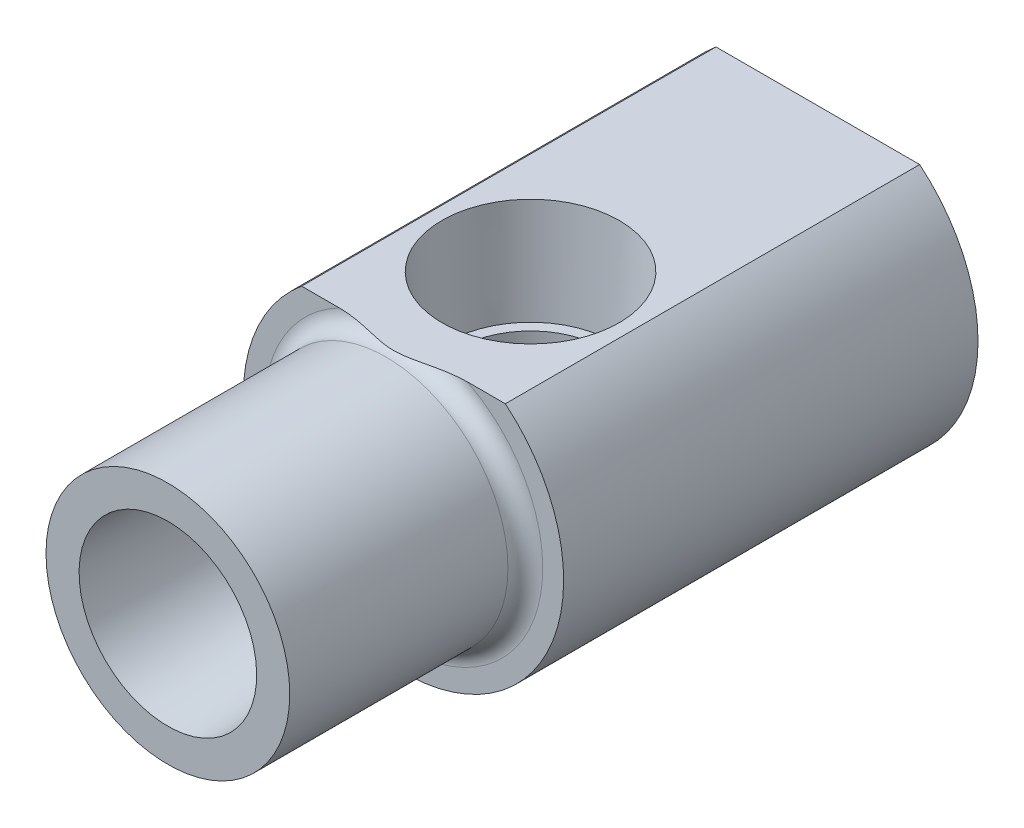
ISO-10303-21;
HEADER;
FILE_DESCRIPTION(('STEP AP214'),'2;1');
FILE_NAME('part.step','',(''),(''),'','','');
FILE_SCHEMA(('AUTOMOTIVE_DESIGN { 1 0 10303 214 1 1 1 1 }'));
ENDSEC;
DATA;
#1=APPLICATION_CONTEXT('core data for automotive mechanical design processes');
#2=APPLICATION_PROTOCOL_DEFINITION('international standard','automotive_design',2000,#1);
#3=PRODUCT_CONTEXT('',#1,'mechanical');
#4=PRODUCT('Part','Part','',(#3));
#5=PRODUCT_RELATED_PRODUCT_CATEGORY('part','',(#4));
#6=PRODUCT_DEFINITION_FORMATION('','',#4);
#7=PRODUCT_DEFINITION_CONTEXT('part definition',#1,'design');
#8=PRODUCT_DEFINITION('design','',#6,#7);
#9=PRODUCT_DEFINITION_SHAPE('','',#8);
#10=(LENGTH_UNIT() NAMED_UNIT(*) SI_UNIT(.MILLI.,.METRE.));
#11=(NAMED_UNIT(*) PLANE_ANGLE_UNIT() SI_UNIT($,.RADIAN.));
#12=(NAMED_UNIT(*) SI_UNIT($,.STERADIAN.) SOLID_ANGLE_UNIT());
#13=UNCERTAINTY_MEASURE_WITH_UNIT(LENGTH_MEASURE(1.E-05),#10,'distance_accuracy_value','');
#14=(GEOMETRIC_REPRESENTATION_CONTEXT(3) GLOBAL_UNCERTAINTY_ASSIGNED_CONTEXT((#13)) GLOBAL_UNIT_ASSIGNED_CONTEXT((#10,
#11,#12)) REPRESENTATION_CONTEXT('',''));
#15=CARTESIAN_POINT('',(0.,0.,0.));
#16=DIRECTION('',(0.,0.,1.));
#17=DIRECTION('',(1.,0.,0.));
#18=AXIS2_PLACEMENT_3D('',#15,#16,#17);
#19=CARTESIAN_POINT('',(-3.175,0.,-7.112));
#20=DIRECTION('',(0.,0.,1.));
#21=DIRECTION('',(1.,0.,0.));
#22=AXIS2_PLACEMENT_3D('',#19,#20,#21);
#23=PLANE('',#22);
#24=CARTESIAN_POINT('',(0.,-0.206790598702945,-7.112));
#25=DIRECTION('',(0.,0.,1.));
#26=DIRECTION('',(0.,1.,0.));
#27=AXIS2_PLACEMENT_3D('',#24,#25,#26);
#28=ELLIPSE('',#27,2.91070678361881,2.77750646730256);
#29=CARTESIAN_POINT('',(0.,2.70391618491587,-7.112));
#30=VERTEX_POINT('',#29);
#31=EDGE_CURVE('E118',#30,#30,#28,.F.);
#32=ORIENTED_EDGE('',*,*,#31,.T.);
#33=EDGE_LOOP('',(#32));
#34=FACE_BOUND('',#33,.T.);
#35=CARTESIAN_POINT('',(0.,0.,-7.11200000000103));
#36=DIRECTION('',(0.,0.,-1.));
#37=DIRECTION('',(0.,1.,0.));
#38=AXIS2_PLACEMENT_3D('',#35,#36,#37);
#39=CIRCLE('',#38,3.51347587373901);
#40=CARTESIAN_POINT('',(0.,3.51347587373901,-7.11200000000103));
#41=VERTEX_POINT('',#40);
#42=EDGE_CURVE('E418',#41,#41,#39,.T.);
#43=ORIENTED_EDGE('',*,*,#42,.F.);
#44=EDGE_LOOP('',(#43));
#45=FACE_BOUND('',#44,.T.);
#46=ADVANCED_FACE('F16',(#34,#45),#23,.T.);
#47=CARTESIAN_POINT('',(-3.175,0.,0.));
#48=DIRECTION('',(0.,0.,1.));
#49=DIRECTION('',(1.,0.,0.));
#50=AXIS2_PLACEMENT_3D('',#47,#48,#49);
#51=PLANE('',#50);
#52=CARTESIAN_POINT('',(0.,0.,0.));
#53=DIRECTION('',(0.,0.,-1.));
#54=DIRECTION('',(0.,1.,0.));
#55=AXIS2_PLACEMENT_3D('',#52,#53,#54);
#56=CIRCLE('',#55,3.8862);
#57=CARTESIAN_POINT('',(0.,3.8862,0.));
#58=VERTEX_POINT('',#57);
#59=EDGE_CURVE('E415',#58,#58,#56,.T.);
#60=ORIENTED_EDGE('',*,*,#59,.T.);
#61=EDGE_LOOP('',(#60));
#62=FACE_BOUND('',#61,.T.);
#63=CARTESIAN_POINT('',(0.,0.,0.));
#64=DIRECTION('',(0.,0.,1.));
#65=DIRECTION('',(1.,0.,0.));
#66=AXIS2_PLACEMENT_3D('',#63,#64,#65);
#67=CIRCLE('',#66,5.334);
#68=CARTESIAN_POINT('',(5.334,0.,0.));
#69=VERTEX_POINT('',#68);
#70=EDGE_CURVE('E420',#69,#69,#67,.F.);
#71=ORIENTED_EDGE('',*,*,#70,.F.);
#72=EDGE_LOOP('',(#71));
#73=FACE_BOUND('',#72,.T.);
#74=ADVANCED_FACE('F143',(#62,#73),#51,.T.);
#75=CARTESIAN_POINT('',(-7.0104,0.,-28.448));
#76=DIRECTION('',(0.,0.,-1.));
#77=DIRECTION('',(-1.,0.,0.));
#78=AXIS2_PLACEMENT_3D('',#75,#76,#77);
#79=PLANE('',#78);
#80=DIRECTION('',(1.,0.,0.));
#81=VECTOR('',#80,1.);
#82=CARTESIAN_POINT('',(-1.83308710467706,3.175,-28.448));
#83=LINE('',#82,#81);
#84=CARTESIAN_POINT('',(-1.83308710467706,3.175,-28.448));
#85=VERTEX_POINT('',#84);
#86=CARTESIAN_POINT('',(1.83308710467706,3.175,-28.448));
#87=VERTEX_POINT('',#86);
#88=EDGE_CURVE('E204',#85,#87,#83,.T.);
#89=ORIENTED_EDGE('',*,*,#88,.F.);
#90=DIRECTION('',(0.5,0.866025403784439,0.));
#91=VECTOR('',#90,1.);
#92=CARTESIAN_POINT('',(-3.66617420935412,0.,-28.448));
#93=LINE('',#92,#91);
#94=CARTESIAN_POINT('',(-3.66617420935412,0.,-28.448));
#95=VERTEX_POINT('',#94);
#96=EDGE_CURVE('E182',#95,#85,#93,.T.);
#97=ORIENTED_EDGE('',*,*,#96,.F.);
#98=DIRECTION('',(-0.5,0.866025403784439,0.));
#99=VECTOR('',#98,1.);
#100=CARTESIAN_POINT('',(-1.83308710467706,-3.175,-28.448));
#101=LINE('',#100,#99);
#102=CARTESIAN_POINT('',(-1.83308710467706,-3.175,-28.448));
#103=VERTEX_POINT('',#102);
#104=EDGE_CURVE('E187',#103,#95,#101,.T.);
#105=ORIENTED_EDGE('',*,*,#104,.F.);
#106=DIRECTION('',(-1.,0.,0.));
#107=VECTOR('',#106,1.);
#108=CARTESIAN_POINT('',(1.83308710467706,-3.175,-28.448));
#109=LINE('',#108,#107);
#110=CARTESIAN_POINT('',(1.83308710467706,-3.175,-28.448));
#111=VERTEX_POINT('',#110);
#112=EDGE_CURVE('E212',#111,#103,#109,.T.);
#113=ORIENTED_EDGE('',*,*,#112,.F.);
#114=DIRECTION('',(-0.5,-0.866025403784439,0.));
#115=VECTOR('',#114,1.);
#116=CARTESIAN_POINT('',(3.66617420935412,0.,-28.448));
#117=LINE('',#116,#115);
#118=CARTESIAN_POINT('',(3.66617420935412,0.,-28.448));
#119=VERTEX_POINT('',#118);
#120=EDGE_CURVE('E209',#119,#111,#117,.T.);
#121=ORIENTED_EDGE('',*,*,#120,.F.);
#122=DIRECTION('',(0.5,-0.866025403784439,0.));
#123=VECTOR('',#122,1.);
#124=CARTESIAN_POINT('',(1.83308710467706,3.175,-28.448));
#125=LINE('',#124,#123);
#126=EDGE_CURVE('E206',#87,#119,#125,.T.);
#127=ORIENTED_EDGE('',*,*,#126,.F.);
#128=EDGE_LOOP('',(#89,#97,#105,#113,#121,#127));
#129=FACE_BOUND('',#128,.T.);
#130=DIRECTION('',(-1.,0.,0.));
#131=VECTOR('',#130,1.);
#132=CARTESIAN_POINT('',(-4.4577,5.41060244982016,-28.448));
#133=LINE('',#132,#131);
#134=CARTESIAN_POINT('',(4.4577,5.41060244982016,-28.448));
#135=VERTEX_POINT('',#134);
#136=CARTESIAN_POINT('',(-4.4577,5.41060244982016,-28.448));
#137=VERTEX_POINT('',#136);
#138=EDGE_CURVE('E81',#135,#137,#133,.T.);
#139=ORIENTED_EDGE('',*,*,#138,.F.);
#140=CARTESIAN_POINT('',(0.,0.,-28.448));
#141=DIRECTION('',(0.,0.,-1.));
#142=DIRECTION('',(-1.,0.,0.));
#143=AXIS2_PLACEMENT_3D('',#140,#141,#142);
#144=CIRCLE('',#143,7.0104);
#145=EDGE_CURVE('E20',#135,#137,#144,.T.);
#146=ORIENTED_EDGE('',*,*,#145,.T.);
#147=EDGE_LOOP('',(#139,#146));
#148=FACE_BOUND('',#147,.T.);
#149=ADVANCED_FACE('F18',(#129,#148),#79,.T.);
#150=CARTESIAN_POINT('',(0.,0.,-75.1971669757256));
#151=DIRECTION('',(0.,0.,-1.));
#152=DIRECTION('',(-1.,0.,0.));
#153=AXIS2_PLACEMENT_3D('',#150,#151,#152);
#154=CYLINDRICAL_SURFACE('',#153,7.0104);
#155=DIRECTION('',(0.,0.,-1.));
#156=VECTOR('',#155,1.);
#157=CARTESIAN_POINT('',(-4.4577,5.41060244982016,0.));
#158=LINE('',#157,#156);
#159=CARTESIAN_POINT('',(-4.4577,5.41060244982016,-10.3124));
#160=VERTEX_POINT('',#159);
#161=EDGE_CURVE('E97',#160,#137,#158,.T.);
#162=ORIENTED_EDGE('',*,*,#161,.T.);
#163=ORIENTED_EDGE('',*,*,#145,.F.);
#164=DIRECTION('',(0.,0.,-1.));
#165=VECTOR('',#164,1.);
#166=CARTESIAN_POINT('',(4.4577,5.41060244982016,0.));
#167=LINE('',#166,#165);
#168=CARTESIAN_POINT('',(4.4577,5.41060244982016,-10.3124));
#169=VERTEX_POINT('',#168);
#170=EDGE_CURVE('E87',#169,#135,#167,.T.);
#171=ORIENTED_EDGE('',*,*,#170,.F.);
#172=CARTESIAN_POINT('',(0.,0.,-10.3124));
#173=DIRECTION('',(0.,0.,-1.));
#174=DIRECTION('',(-1.,0.,0.));
#175=AXIS2_PLACEMENT_3D('',#172,#173,#174);
#176=CIRCLE('',#175,7.0104);
#177=EDGE_CURVE('E104',#169,#160,#176,.T.);
#178=ORIENTED_EDGE('',*,*,#177,.T.);
#179=EDGE_LOOP('',(#162,#163,#171,#178));
#180=FACE_BOUND('',#179,.T.);
#181=ADVANCED_FACE('F102',(#180),#154,.T.);
#182=CARTESIAN_POINT('',(-6.096,0.,-10.3124));
#183=DIRECTION('',(0.,0.,1.));
#184=DIRECTION('',(1.,0.,0.));
#185=AXIS2_PLACEMENT_3D('',#182,#183,#184);
#186=PLANE('',#185);
#187=DIRECTION('',(1.,0.,0.));
#188=VECTOR('',#187,1.);
#189=CARTESIAN_POINT('',(-6.096,5.41060244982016,-10.3124));
#190=LINE('',#189,#188);
#191=CARTESIAN_POINT('',(-2.80830858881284,5.41060244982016,-10.3124));
#192=VERTEX_POINT('',#191);
#193=EDGE_CURVE('E241',#160,#192,#190,.T.);
#194=ORIENTED_EDGE('',*,*,#193,.F.);
#195=ORIENTED_EDGE('',*,*,#177,.F.);
#196=CARTESIAN_POINT('',(2.80830858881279,5.41060244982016,-10.3124000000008));
#197=VERTEX_POINT('',#196);
#198=EDGE_CURVE('E92',#197,#169,#190,.T.);
#199=ORIENTED_EDGE('',*,*,#198,.F.);
#200=CARTESIAN_POINT('',(0.,0.,-10.3124));
#201=DIRECTION('',(0.,0.,-1.));
#202=DIRECTION('',(-1.,0.,0.));
#203=AXIS2_PLACEMENT_3D('',#200,#201,#202);
#204=CIRCLE('',#203,6.096);
#205=EDGE_CURVE('E107',#197,#192,#204,.T.);
#206=ORIENTED_EDGE('',*,*,#205,.T.);
#207=EDGE_LOOP('',(#194,#195,#199,#206));
#208=FACE_BOUND('',#207,.T.);
#209=ADVANCED_FACE('F138',(#208),#186,.T.);
#210=CARTESIAN_POINT('',(0.,0.,-9.5504));
#211=DIRECTION('',(0.,0.,-1.));
#212=DIRECTION('',(-1.,0.,0.));
#213=AXIS2_PLACEMENT_3D('',#210,#211,#212);
#214=TOROIDAL_SURFACE('',#213,6.096,0.762);
#215=CARTESIAN_POINT('',(0.,5.41060244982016,-9.8833777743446));
#216=CARTESIAN_POINT('',(0.0521470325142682,5.41060244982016,-9.88336622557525));
#217=CARTESIAN_POINT('',(0.104287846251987,5.41060244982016,-9.88494210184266));
#218=CARTESIAN_POINT('',(0.208401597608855,5.41060244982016,-9.89103164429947));
#219=CARTESIAN_POINT('',(0.260374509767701,5.41060244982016,-9.89554573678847));
#220=CARTESIAN_POINT('',(0.416241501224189,5.41060244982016,-9.91284832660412));
#221=CARTESIAN_POINT('',(0.519704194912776,5.41060244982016,-9.92939143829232));
#222=CARTESIAN_POINT('',(0.726918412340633,5.41060244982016,-9.96801986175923));
#223=CARTESIAN_POINT('',(0.830655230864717,5.41060244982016,-9.99017646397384));
#224=CARTESIAN_POINT('',(1.03759009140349,5.41060244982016,-10.0362404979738));
#225=CARTESIAN_POINT('',(1.14078865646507,5.41060244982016,-10.0601456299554));
#226=CARTESIAN_POINT('',(1.34834228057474,5.41060244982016,-10.1076053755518));
#227=CARTESIAN_POINT('',(1.4526986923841,5.41060244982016,-10.1311541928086));
#228=CARTESIAN_POINT('',(1.66197970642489,5.41060244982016,-10.175860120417));
#229=CARTESIAN_POINT('',(1.76690452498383,5.41060244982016,-10.1970162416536));
#230=CARTESIAN_POINT('',(1.97693672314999,5.41060244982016,-10.2352529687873));
#231=CARTESIAN_POINT('',(2.08204009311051,5.41060244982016,-10.2523548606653));
#232=CARTESIAN_POINT('',(2.29298648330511,5.41060244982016,-10.2810452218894));
#233=CARTESIAN_POINT('',(2.39882937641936,5.41060244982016,-10.2926346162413));
#234=CARTESIAN_POINT('',(2.63825679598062,5.41060244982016,-10.3105707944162));
#235=CARTESIAN_POINT('',(2.77203238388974,5.41060244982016,-10.3148268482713));
#236=CARTESIAN_POINT('',(2.97236053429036,5.41060244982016,-10.3091542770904));
#237=CARTESIAN_POINT('',(3.03908464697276,5.41060244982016,-10.3052533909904));
#238=CARTESIAN_POINT('',(3.17206397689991,5.41060244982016,-10.292650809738));
#239=CARTESIAN_POINT('',(3.2383194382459,5.41060244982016,-10.2839518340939));
#240=CARTESIAN_POINT('',(3.37725624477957,5.41060244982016,-10.25951512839));
#241=CARTESIAN_POINT('',(3.44982215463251,5.41060244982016,-10.24309575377));
#242=CARTESIAN_POINT('',(3.59245961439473,5.41060244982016,-10.2014714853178));
#243=CARTESIAN_POINT('',(3.6625332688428,5.41060244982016,-10.1762742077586));
#244=CARTESIAN_POINT('',(3.77900159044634,5.41060244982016,-10.1234231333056));
#245=CARTESIAN_POINT('',(3.82657256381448,5.41060244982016,-10.0983897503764));
#246=CARTESIAN_POINT('',(3.91754959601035,5.41060244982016,-10.041584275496));
#247=CARTESIAN_POINT('',(3.96096325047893,5.41060244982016,-10.0098248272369));
#248=CARTESIAN_POINT('',(4.02798010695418,5.41060244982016,-9.95029070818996));
#249=CARTESIAN_POINT('',(4.05342428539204,5.41060244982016,-9.92459895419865));
#250=CARTESIAN_POINT('',(4.10009948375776,5.41060244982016,-9.86961585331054));
#251=CARTESIAN_POINT('',(4.12133630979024,5.41060244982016,-9.84032955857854));
#252=CARTESIAN_POINT('',(4.15466127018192,5.41060244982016,-9.78428761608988));
#253=CARTESIAN_POINT('',(4.16772173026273,5.41060244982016,-9.75811424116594));
#254=CARTESIAN_POINT('',(4.18933719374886,5.41060244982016,-9.70395677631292));
#255=CARTESIAN_POINT('',(4.19789541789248,5.41060244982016,-9.67597399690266));
#256=CARTESIAN_POINT('',(4.20987180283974,5.41060244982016,-9.61873424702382));
#257=CARTESIAN_POINT('',(4.21325884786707,5.41060244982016,-9.58947064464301));
#258=CARTESIAN_POINT('',(4.21447858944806,5.41060244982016,-9.53082898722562));
#259=CARTESIAN_POINT('',(4.21231242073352,5.41060244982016,-9.50145095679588));
#260=CARTESIAN_POINT('',(4.20309810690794,5.41060244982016,-9.44636463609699));
#261=CARTESIAN_POINT('',(4.19653350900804,5.41060244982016,-9.42057293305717));
#262=CARTESIAN_POINT('',(4.17948851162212,5.41060244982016,-9.37033011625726));
#263=CARTESIAN_POINT('',(4.16900680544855,5.41060244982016,-9.34587945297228));
#264=CARTESIAN_POINT('',(4.14035818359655,5.41060244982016,-9.29025200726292));
#265=CARTESIAN_POINT('',(4.12078333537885,5.41060244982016,-9.25980126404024));
#266=CARTESIAN_POINT('',(4.07697861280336,5.41060244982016,-9.20246009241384));
#267=CARTESIAN_POINT('',(4.05273917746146,5.41060244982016,-9.17557717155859));
#268=CARTESIAN_POINT('',(3.98868725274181,5.41060244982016,-9.11355610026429));
#269=CARTESIAN_POINT('',(3.94690497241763,5.41060244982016,-9.080464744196));
#270=CARTESIAN_POINT('',(3.85879527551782,5.41060244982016,-9.02109366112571));
#271=CARTESIAN_POINT('',(3.81245915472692,5.41060244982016,-8.99482734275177));
#272=CARTESIAN_POINT('',(3.7245267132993,5.41060244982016,-8.95184585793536));
#273=CARTESIAN_POINT('',(3.68333828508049,5.41060244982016,-8.93427731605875));
#274=CARTESIAN_POINT('',(3.59958587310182,5.41060244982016,-8.90276046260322));
#275=CARTESIAN_POINT('',(3.55702092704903,5.41060244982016,-8.88881474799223));
#276=CARTESIAN_POINT('',(3.42786902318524,5.41060244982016,-8.85169021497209));
#277=CARTESIAN_POINT('',(3.33991210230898,5.41060244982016,-8.83326351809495));
#278=CARTESIAN_POINT('',(3.16528158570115,5.41060244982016,-8.80664033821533));
#279=CARTESIAN_POINT('',(3.07864723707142,5.41060244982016,-8.7981567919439));
#280=CARTESIAN_POINT('',(2.90489485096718,5.41060244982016,-8.78853139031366));
#281=CARTESIAN_POINT('',(2.8177763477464,5.41060244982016,-8.78739862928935));
#282=CARTESIAN_POINT('',(2.64327811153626,5.41060244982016,-8.79105046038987));
#283=CARTESIAN_POINT('',(2.55589913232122,5.41060244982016,-8.79586348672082));
#284=CARTESIAN_POINT('',(2.38166962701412,5.41060244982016,-8.81026497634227));
#285=CARTESIAN_POINT('',(2.29481855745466,5.41060244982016,-8.81984715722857));
#286=CARTESIAN_POINT('',(2.01384766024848,5.41060244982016,-8.85707093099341));
#287=CARTESIAN_POINT('',(1.82076533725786,5.41060244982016,-8.89234569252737));
#288=CARTESIAN_POINT('',(1.53229430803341,5.41060244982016,-8.95228462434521));
#289=CARTESIAN_POINT('',(1.43609183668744,5.41060244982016,-8.97349691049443));
#290=CARTESIAN_POINT('',(1.24390982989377,5.41060244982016,-9.01693418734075));
#291=CARTESIAN_POINT('',(1.14793028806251,5.41060244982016,-9.03915914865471));
#292=CARTESIAN_POINT('',(0.957697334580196,5.41060244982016,-9.0824933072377));
#293=CARTESIAN_POINT('',(0.863446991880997,5.41060244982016,-9.10361583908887));
#294=CARTESIAN_POINT('',(0.674290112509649,5.41060244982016,-9.14294449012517));
#295=CARTESIAN_POINT('',(0.579383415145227,5.41060244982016,-9.16114986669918));
#296=CARTESIAN_POINT('',(0.389272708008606,5.41060244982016,-9.19115341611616));
#297=CARTESIAN_POINT('',(0.294077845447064,5.41060244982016,-9.20300397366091));
#298=CARTESIAN_POINT('',(0.15079180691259,5.41060244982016,-9.21353954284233));
#299=CARTESIAN_POINT('',(0.102969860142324,5.41060244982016,-9.21584529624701));
#300=CARTESIAN_POINT('',(0.0072742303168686,5.41060244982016,-9.21784449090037));
#301=CARTESIAN_POINT('',(-0.0405994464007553,5.41060244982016,-9.2175382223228));
#302=CARTESIAN_POINT('',(-0.136934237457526,5.41060244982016,-9.21431711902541));
#303=CARTESIAN_POINT('',(-0.185394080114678,5.41060244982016,-9.21136543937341));
#304=CARTESIAN_POINT('',(-0.282118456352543,5.41060244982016,-9.20308955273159));
#305=CARTESIAN_POINT('',(-0.330382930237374,5.41060244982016,-9.19776466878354));
#306=CARTESIAN_POINT('',(-0.475151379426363,5.41060244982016,-9.17884930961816));
#307=CARTESIAN_POINT('',(-0.571263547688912,5.41060244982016,-9.16233640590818));
#308=CARTESIAN_POINT('',(-0.764047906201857,5.41060244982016,-9.12496585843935));
#309=CARTESIAN_POINT('',(-0.860707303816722,5.41060244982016,-9.10404748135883));
#310=CARTESIAN_POINT('',(-1.05357295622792,5.41060244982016,-9.06085991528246));
#311=CARTESIAN_POINT('',(-1.1497796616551,5.41060244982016,-9.03859270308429));
#312=CARTESIAN_POINT('',(-1.36433899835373,5.41060244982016,-8.98954401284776));
#313=CARTESIAN_POINT('',(-1.48272280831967,5.41060244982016,-8.96289520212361));
#314=CARTESIAN_POINT('',(-1.72029970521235,5.41060244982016,-8.91297309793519));
#315=CARTESIAN_POINT('',(-1.83949323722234,5.41060244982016,-8.88970185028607));
#316=CARTESIAN_POINT('',(-2.07789765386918,5.41060244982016,-8.84899103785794));
#317=CARTESIAN_POINT('',(-2.19710038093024,5.41060244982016,-8.83150521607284));
#318=CARTESIAN_POINT('',(-2.43636519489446,5.41060244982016,-8.80446389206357));
#319=CARTESIAN_POINT('',(-2.55642644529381,5.41060244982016,-8.79490151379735));
#320=CARTESIAN_POINT('',(-2.76780194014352,5.41060244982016,-8.78756409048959));
#321=CARTESIAN_POINT('',(-2.85902659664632,5.41060244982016,-8.78749285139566));
#322=CARTESIAN_POINT('',(-3.04144991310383,5.41060244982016,-8.79515186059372));
#323=CARTESIAN_POINT('',(-3.13264774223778,5.41060244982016,-8.80290456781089));
#324=CARTESIAN_POINT('',(-3.31458996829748,5.41060244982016,-8.82848619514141));
#325=CARTESIAN_POINT('',(-3.40532344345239,5.41060244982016,-8.84640255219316));
#326=CARTESIAN_POINT('',(-3.53857286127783,5.41060244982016,-8.88309892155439));
#327=CARTESIAN_POINT('',(-3.58245316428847,5.41060244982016,-8.89694110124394));
#328=CARTESIAN_POINT('',(-3.6688305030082,5.41060244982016,-8.92838510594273));
#329=CARTESIAN_POINT('',(-3.71132868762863,5.41060244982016,-8.94598371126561));
#330=CARTESIAN_POINT('',(-3.79234387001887,5.41060244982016,-8.98457819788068));
#331=CARTESIAN_POINT('',(-3.83095410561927,5.41060244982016,-9.00537576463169));
#332=CARTESIAN_POINT('',(-3.90549335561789,5.41060244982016,-9.05148100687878));
#333=CARTESIAN_POINT('',(-3.94141935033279,5.41060244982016,-9.07679365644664));
#334=CARTESIAN_POINT('',(-4.00964525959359,5.41060244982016,-9.13279277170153));
#335=CARTESIAN_POINT('',(-4.04189445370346,5.41060244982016,-9.16354222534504));
#336=CARTESIAN_POINT('',(-4.10014383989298,5.41060244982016,-9.23048494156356));
#337=CARTESIAN_POINT('',(-4.12616464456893,5.41060244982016,-9.26665958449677));
#338=CARTESIAN_POINT('',(-4.16162371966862,5.41060244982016,-9.33016031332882));
#339=CARTESIAN_POINT('',(-4.17366550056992,5.41060244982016,-9.35603381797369));
#340=CARTESIAN_POINT('',(-4.19334521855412,5.41060244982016,-9.40941407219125));
#341=CARTESIAN_POINT('',(-4.20098675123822,5.41060244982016,-9.43691946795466));
#342=CARTESIAN_POINT('',(-4.21130602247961,5.41060244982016,-9.49300948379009));
#343=CARTESIAN_POINT('',(-4.21395773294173,5.41060244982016,-9.52159897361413));
#344=CARTESIAN_POINT('',(-4.21398264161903,5.41060244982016,-9.57878062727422));
#345=CARTESIAN_POINT('',(-4.21135613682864,5.41060244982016,-9.60737279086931));
#346=CARTESIAN_POINT('',(-4.20143815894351,5.41060244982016,-9.66155976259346));
#347=CARTESIAN_POINT('',(-4.1945008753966,5.41060244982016,-9.68722109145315));
#348=CARTESIAN_POINT('',(-4.17676949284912,5.41060244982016,-9.73716185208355));
#349=CARTESIAN_POINT('',(-4.1659739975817,5.41060244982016,-9.76144077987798));
#350=CARTESIAN_POINT('',(-4.13643456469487,5.41060244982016,-9.81706409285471));
#351=CARTESIAN_POINT('',(-4.11622825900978,5.41060244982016,-9.84763117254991));
#352=CARTESIAN_POINT('',(-4.07115731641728,5.41060244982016,-9.90510927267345));
#353=CARTESIAN_POINT('',(-4.04628281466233,5.41060244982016,-9.93201233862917));
#354=CARTESIAN_POINT('',(-3.98047143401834,5.41060244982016,-9.99419695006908));
#355=CARTESIAN_POINT('',(-3.93753463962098,5.41060244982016,-10.0273489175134));
#356=CARTESIAN_POINT('',(-3.84713170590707,5.41060244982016,-10.0866768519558));
#357=CARTESIAN_POINT('',(-3.79965701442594,5.41060244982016,-10.1128392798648));
#358=CARTESIAN_POINT('',(-3.70945527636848,5.41060244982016,-10.1556191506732));
#359=CARTESIAN_POINT('',(-3.66712202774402,5.41060244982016,-10.1730859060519));
#360=CARTESIAN_POINT('',(-3.58109351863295,5.41060244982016,-10.2043030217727));
#361=CARTESIAN_POINT('',(-3.53739729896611,5.41060244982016,-10.218050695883));
#362=CARTESIAN_POINT('',(-3.4048693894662,5.41060244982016,-10.2544695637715));
#363=CARTESIAN_POINT('',(-3.3146965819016,5.41060244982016,-10.2722735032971));
#364=CARTESIAN_POINT('',(-3.13512177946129,5.41060244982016,-10.2975720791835));
#365=CARTESIAN_POINT('',(-3.04574747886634,5.41060244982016,-10.3052878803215));
#366=CARTESIAN_POINT('',(-2.86659161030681,5.41060244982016,-10.3131574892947));
#367=CARTESIAN_POINT('',(-2.77680968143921,5.41060244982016,-10.3133021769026));
#368=CARTESIAN_POINT('',(-2.59707026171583,5.41060244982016,-10.3075298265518));
#369=CARTESIAN_POINT('',(-2.5071138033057,5.41060244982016,-10.3015854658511));
#370=CARTESIAN_POINT('',(-2.32777785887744,5.41060244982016,-10.2848498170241));
#371=CARTESIAN_POINT('',(-2.23839782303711,5.41060244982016,-10.2740641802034));
#372=CARTESIAN_POINT('',(-1.96748151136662,5.41060244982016,-10.2354986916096));
#373=CARTESIAN_POINT('',(-1.78682109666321,5.41060244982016,-10.2017132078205));
#374=CARTESIAN_POINT('',(-1.51682052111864,5.41060244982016,-10.1451135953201));
#375=CARTESIAN_POINT('',(-1.42679945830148,5.41060244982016,-10.1252126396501));
#376=CARTESIAN_POINT('',(-1.24695389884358,5.41060244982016,-10.0845437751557));
#377=CARTESIAN_POINT('',(-1.1571293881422,5.41060244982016,-10.0637759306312));
#378=CARTESIAN_POINT('',(-0.979057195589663,5.41060244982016,-10.0231394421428));
#379=CARTESIAN_POINT('',(-0.890811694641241,5.41060244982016,-10.003261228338));
#380=CARTESIAN_POINT('',(-0.713780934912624,5.41060244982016,-9.96580183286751));
#381=CARTESIAN_POINT('',(-0.624995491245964,5.41060244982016,-9.9482214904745));
#382=CARTESIAN_POINT('',(-0.447203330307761,5.41060244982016,-9.91806015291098));
#383=CARTESIAN_POINT('',(-0.35820314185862,5.41060244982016,-9.90544303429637));
#384=CARTESIAN_POINT('',(-0.1794617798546,5.41060244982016,-9.88811676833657));
#385=CARTESIAN_POINT('',(-0.08972168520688,5.41060244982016,-9.88339764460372));
#386=CARTESIAN_POINT('',(0.,5.41060244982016,-9.8833777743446));
#387=B_SPLINE_CURVE_WITH_KNOTS('',3,(#215,#216,#217,#218,#219,#220,#221,#222,#223,#224,#225,
#226,#227,#228,#229,#230,#231,#232,#233,#234,#235,#236,#237,#238,#239,#240,#241,#242,#243,#244,
#245,#246,#247,#248,#249,#250,#251,#252,#253,#254,#255,#256,#257,#258,#259,#260,#261,#262,#263,
#264,#265,#266,#267,#268,#269,#270,#271,#272,#273,#274,#275,#276,#277,#278,#279,#280,#281,#282,
#283,#284,#285,#286,#287,#288,#289,#290,#291,#292,#293,#294,#295,#296,#297,#298,#299,#300,#301,
#302,#303,#304,#305,#306,#307,#308,#309,#310,#311,#312,#313,#314,#315,#316,#317,#318,#319,#320,
#321,#322,#323,#324,#325,#326,#327,#328,#329,#330,#331,#332,#333,#334,#335,#336,#337,#338,#339,
#340,#341,#342,#343,#344,#345,#346,#347,#348,#349,#350,#351,#352,#353,#354,#355,#356,#357,#358,
#359,#360,#361,#362,#363,#364,#365,#366,#367,#368,#369,#370,#371,#372,#373,#374,#375,#376,#377,
#378,#379,#380,#381,#382,#383,#384,#385,#386),.UNSPECIFIED.,.T.,.F.,(4,2,2,2,2,2,2,2,2,2,2,2,2,
2,2,2,2,2,2,2,2,2,2,2,2,2,2,2,2,2,2,2,2,2,2,2,2,2,2,2,2,2,2,2,2,2,2,2,2,2,2,2,2,2,2,2,2,2,2,2,2,
2,2,2,2,2,2,2,2,2,2,2,2,2,2,2,2,2,2,2,2,2,2,2,2,4),(0.,0.156408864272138,0.312840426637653,
0.626836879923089,0.945040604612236,1.2628330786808,1.5837652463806,1.90482960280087,
2.22416896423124,2.54345472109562,2.9441659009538,3.14454518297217,3.34481100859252,
3.56760205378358,3.79020027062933,3.95104939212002,4.11159879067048,4.21974493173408,
4.32774077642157,4.41514397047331,4.50248455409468,4.59034863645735,4.67819476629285,
4.75769203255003,4.83721584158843,4.94521135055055,5.05343062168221,5.21243854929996,
5.37175654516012,5.5059015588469,5.64014246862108,5.90890810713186,6.16970670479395,
6.43082789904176,6.69320268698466,6.95523275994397,7.54340798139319,7.83896772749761,
8.13451890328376,8.4242729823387,8.71410070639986,9.0015010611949,9.14506775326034,
9.28861849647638,9.43420020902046,9.57982347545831,9.87216797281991,10.1688428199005,
10.4650929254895,10.8291174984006,11.1933616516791,11.5546188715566,11.9155622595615,
12.1889721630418,12.4631691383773,12.7397615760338,12.8776619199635,13.0154445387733,
13.1467577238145,13.2782164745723,13.4113120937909,13.5439609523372,13.6292456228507,
13.7144605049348,13.8001186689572,13.885772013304,13.9651785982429,14.0446139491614,
14.1539273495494,14.2634744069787,14.4253063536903,14.5874495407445,14.7246386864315,
14.8619266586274,15.1368206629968,15.4055810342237,15.6746651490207,15.9449620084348,
16.2149441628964,16.7658370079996,17.0424344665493,17.319011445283,17.5903768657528,
17.8618411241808,18.131291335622,18.4004009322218),.UNSPECIFIED.);
#388=EDGE_CURVE('E103',#192,#197,#387,.T.);
#389=ORIENTED_EDGE('',*,*,#388,.F.);
#390=ORIENTED_EDGE('',*,*,#205,.F.);
#391=EDGE_LOOP('',(#389,#390));
#392=FACE_BOUND('',#391,.T.);
#393=CARTESIAN_POINT('',(0.,0.,-9.5504));
#394=DIRECTION('',(0.,0.,-1.));
#395=DIRECTION('',(-1.,0.,0.));
#396=AXIS2_PLACEMENT_3D('',#393,#394,#395);
#397=CIRCLE('',#396,5.334);
#398=CARTESIAN_POINT('',(-5.334,0.,-9.5504));
#399=VERTEX_POINT('',#398);
#400=EDGE_CURVE('E110',#399,#399,#397,.T.);
#401=ORIENTED_EDGE('',*,*,#400,.T.);
#402=EDGE_LOOP('',(#401));
#403=FACE_BOUND('',#402,.T.);
#404=ADVANCED_FACE('F120',(#392,#403),#214,.F.);
#405=CARTESIAN_POINT('',(0.,0.,-75.1971669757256));
#406=DIRECTION('',(0.,0.,-1.));
#407=DIRECTION('',(-1.,0.,0.));
#408=AXIS2_PLACEMENT_3D('',#405,#406,#407);
#409=CYLINDRICAL_SURFACE('',#408,5.334);
#410=ORIENTED_EDGE('',*,*,#400,.F.);
#411=EDGE_LOOP('',(#410));
#412=FACE_BOUND('',#411,.T.);
#413=ORIENTED_EDGE('',*,*,#70,.T.);
#414=EDGE_LOOP('',(#413));
#415=FACE_BOUND('',#414,.T.);
#416=ADVANCED_FACE('F128',(#412,#415),#409,.T.);
#417=CARTESIAN_POINT('',(-4.4577,5.41060244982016,0.));
#418=DIRECTION('',(0.,-1.,0.));
#419=DIRECTION('',(0.,0.,-1.));
#420=AXIS2_PLACEMENT_3D('',#417,#418,#419);
#421=PLANE('',#420);
#422=CARTESIAN_POINT('',(0.,5.41060244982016,-15.875));
#423=DIRECTION('',(0.,-1.,0.));
#424=DIRECTION('',(0.,0.,-1.));
#425=AXIS2_PLACEMENT_3D('',#422,#423,#424);
#426=CIRCLE('',#425,3.8800785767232);
#427=CARTESIAN_POINT('',(0.,5.41060244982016,-19.7550785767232));
#428=VERTEX_POINT('',#427);
#429=EDGE_CURVE('E425',#428,#428,#426,.T.);
#430=ORIENTED_EDGE('',*,*,#429,.T.);
#431=EDGE_LOOP('',(#430));
#432=FACE_BOUND('',#431,.T.);
#433=ORIENTED_EDGE('',*,*,#193,.T.);
#434=ORIENTED_EDGE('',*,*,#388,.T.);
#435=ORIENTED_EDGE('',*,*,#198,.T.);
#436=ORIENTED_EDGE('',*,*,#170,.T.);
#437=ORIENTED_EDGE('',*,*,#138,.T.);
#438=ORIENTED_EDGE('',*,*,#161,.F.);
#439=EDGE_LOOP('',(#433,#434,#435,#436,#437,#438));
#440=FACE_BOUND('',#439,.T.);
#441=ADVANCED_FACE('F89',(#432,#440),#421,.F.);
#442=CARTESIAN_POINT('',(-1.83308710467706,3.175,-24.5364));
#443=DIRECTION('',(0.,1.,0.));
#444=DIRECTION('',(-1.,0.,0.));
#445=AXIS2_PLACEMENT_3D('',#442,#443,#444);
#446=PLANE('',#445);
#447=ORIENTED_EDGE('',*,*,#88,.T.);
#448=DIRECTION('',(0.,0.,-1.));
#449=VECTOR('',#448,1.);
#450=CARTESIAN_POINT('',(1.83308710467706,3.175,-24.5364));
#451=LINE('',#450,#449);
#452=CARTESIAN_POINT('',(1.83308710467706,3.175,-23.622));
#453=VERTEX_POINT('',#452);
#454=EDGE_CURVE('E197',#453,#87,#451,.T.);
#455=ORIENTED_EDGE('',*,*,#454,.F.);
#456=DIRECTION('',(1.,0.,0.));
#457=VECTOR('',#456,1.);
#458=CARTESIAN_POINT('',(-1.83308710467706,3.175,-23.622));
#459=LINE('',#458,#457);
#460=CARTESIAN_POINT('',(-1.83308710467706,3.175,-23.622));
#461=VERTEX_POINT('',#460);
#462=EDGE_CURVE('E174',#461,#453,#459,.T.);
#463=ORIENTED_EDGE('',*,*,#462,.F.);
#464=DIRECTION('',(0.,0.,-1.));
#465=VECTOR('',#464,1.);
#466=CARTESIAN_POINT('',(-1.83308710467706,3.175,-24.5364));
#467=LINE('',#466,#465);
#468=EDGE_CURVE('E101',#461,#85,#467,.T.);
#469=ORIENTED_EDGE('',*,*,#468,.T.);
#470=EDGE_LOOP('',(#447,#455,#463,#469));
#471=FACE_BOUND('',#470,.T.);
#472=ADVANCED_FACE('F127',(#471),#446,.F.);
#473=CARTESIAN_POINT('',(-3.66617420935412,0.,-24.5364));
#474=DIRECTION('',(-0.866025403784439,0.5,0.));
#475=DIRECTION('',(-0.5,-0.866025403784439,0.));
#476=AXIS2_PLACEMENT_3D('',#473,#474,#475);
#477=PLANE('',#476);
#478=ORIENTED_EDGE('',*,*,#96,.T.);
#479=ORIENTED_EDGE('',*,*,#468,.F.);
#480=DIRECTION('',(0.5,0.866025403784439,0.));
#481=VECTOR('',#480,1.);
#482=CARTESIAN_POINT('',(-3.66617420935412,0.,-23.622));
#483=LINE('',#482,#481);
#484=CARTESIAN_POINT('',(-3.66617420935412,0.,-23.622));
#485=VERTEX_POINT('',#484);
#486=EDGE_CURVE('E180',#485,#461,#483,.T.);
#487=ORIENTED_EDGE('',*,*,#486,.F.);
#488=DIRECTION('',(0.,0.,-1.));
#489=VECTOR('',#488,1.);
#490=CARTESIAN_POINT('',(-3.66617420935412,0.,-24.5364));
#491=LINE('',#490,#489);
#492=EDGE_CURVE('E221',#485,#95,#491,.T.);
#493=ORIENTED_EDGE('',*,*,#492,.T.);
#494=EDGE_LOOP('',(#478,#479,#487,#493));
#495=FACE_BOUND('',#494,.T.);
#496=ADVANCED_FACE('F228',(#495),#477,.F.);
#497=CARTESIAN_POINT('',(-1.83308710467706,-3.175,-24.5364));
#498=DIRECTION('',(-0.866025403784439,-0.5,0.));
#499=DIRECTION('',(0.5,-0.866025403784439,0.));
#500=AXIS2_PLACEMENT_3D('',#497,#498,#499);
#501=PLANE('',#500);
#502=ORIENTED_EDGE('',*,*,#104,.T.);
#503=ORIENTED_EDGE('',*,*,#492,.F.);
#504=DIRECTION('',(-0.5,0.866025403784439,0.));
#505=VECTOR('',#504,1.);
#506=CARTESIAN_POINT('',(-1.83308710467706,-3.175,-23.622));
#507=LINE('',#506,#505);
#508=CARTESIAN_POINT('',(-1.83308710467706,-3.175,-23.622));
#509=VERTEX_POINT('',#508);
#510=EDGE_CURVE('E198',#509,#485,#507,.T.);
#511=ORIENTED_EDGE('',*,*,#510,.F.);
#512=DIRECTION('',(0.,0.,-1.));
#513=VECTOR('',#512,1.);
#514=CARTESIAN_POINT('',(-1.83308710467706,-3.175,-24.5364));
#515=LINE('',#514,#513);
#516=EDGE_CURVE('E222',#509,#103,#515,.T.);
#517=ORIENTED_EDGE('',*,*,#516,.T.);
#518=EDGE_LOOP('',(#502,#503,#511,#517));
#519=FACE_BOUND('',#518,.T.);
#520=ADVANCED_FACE('F219',(#519),#501,.F.);
#521=CARTESIAN_POINT('',(1.83308710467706,-3.175,-24.5364));
#522=DIRECTION('',(0.,-1.,0.));
#523=DIRECTION('',(1.,0.,0.));
#524=AXIS2_PLACEMENT_3D('',#521,#522,#523);
#525=PLANE('',#524);
#526=ORIENTED_EDGE('',*,*,#112,.T.);
#527=ORIENTED_EDGE('',*,*,#516,.F.);
#528=DIRECTION('',(-1.,0.,0.));
#529=VECTOR('',#528,1.);
#530=CARTESIAN_POINT('',(1.83308710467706,-3.175,-23.622));
#531=LINE('',#530,#529);
#532=CARTESIAN_POINT('',(1.83308710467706,-3.175,-23.622));
#533=VERTEX_POINT('',#532);
#534=EDGE_CURVE('E200',#533,#509,#531,.T.);
#535=ORIENTED_EDGE('',*,*,#534,.F.);
#536=DIRECTION('',(0.,0.,-1.));
#537=VECTOR('',#536,1.);
#538=CARTESIAN_POINT('',(1.83308710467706,-3.175,-24.5364));
#539=LINE('',#538,#537);
#540=EDGE_CURVE('E231',#533,#111,#539,.T.);
#541=ORIENTED_EDGE('',*,*,#540,.T.);
#542=EDGE_LOOP('',(#526,#527,#535,#541));
#543=FACE_BOUND('',#542,.T.);
#544=ADVANCED_FACE('F301',(#543),#525,.F.);
#545=CARTESIAN_POINT('',(3.66617420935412,0.,-24.5364));
#546=DIRECTION('',(0.866025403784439,-0.5,0.));
#547=DIRECTION('',(0.5,0.866025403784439,0.));
#548=AXIS2_PLACEMENT_3D('',#545,#546,#547);
#549=PLANE('',#548);
#550=ORIENTED_EDGE('',*,*,#120,.T.);
#551=ORIENTED_EDGE('',*,*,#540,.F.);
#552=DIRECTION('',(-0.5,-0.866025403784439,0.));
#553=VECTOR('',#552,1.);
#554=CARTESIAN_POINT('',(3.66617420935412,0.,-23.622));
#555=LINE('',#554,#553);
#556=CARTESIAN_POINT('',(3.66617420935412,0.,-23.622));
#557=VERTEX_POINT('',#556);
#558=EDGE_CURVE('E184',#557,#533,#555,.T.);
#559=ORIENTED_EDGE('',*,*,#558,.F.);
#560=DIRECTION('',(0.,0.,-1.));
#561=VECTOR('',#560,1.);
#562=CARTESIAN_POINT('',(3.66617420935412,0.,-24.5364));
#563=LINE('',#562,#561);
#564=EDGE_CURVE('E236',#557,#119,#563,.T.);
#565=ORIENTED_EDGE('',*,*,#564,.T.);
#566=EDGE_LOOP('',(#550,#551,#559,#565));
#567=FACE_BOUND('',#566,.T.);
#568=ADVANCED_FACE('F168',(#567),#549,.F.);
#569=CARTESIAN_POINT('',(1.83308710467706,3.175,-24.5364));
#570=DIRECTION('',(0.866025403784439,0.5,0.));
#571=DIRECTION('',(-0.5,0.866025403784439,0.));
#572=AXIS2_PLACEMENT_3D('',#569,#570,#571);
#573=PLANE('',#572);
#574=ORIENTED_EDGE('',*,*,#126,.T.);
#575=ORIENTED_EDGE('',*,*,#564,.F.);
#576=DIRECTION('',(0.5,-0.866025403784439,0.));
#577=VECTOR('',#576,1.);
#578=CARTESIAN_POINT('',(1.83308710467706,3.175,-23.622));
#579=LINE('',#578,#577);
#580=EDGE_CURVE('E177',#453,#557,#579,.T.);
#581=ORIENTED_EDGE('',*,*,#580,.F.);
#582=ORIENTED_EDGE('',*,*,#454,.T.);
#583=EDGE_LOOP('',(#574,#575,#581,#582));
#584=FACE_BOUND('',#583,.T.);
#585=ADVANCED_FACE('F158',(#584),#573,.F.);
#586=CARTESIAN_POINT('',(0.,0.,-23.622));
#587=DIRECTION('',(0.,0.,-1.));
#588=DIRECTION('',(-1.,0.,0.));
#589=AXIS2_PLACEMENT_3D('',#586,#587,#588);
#590=PLANE('',#589);
#591=ORIENTED_EDGE('',*,*,#462,.T.);
#592=ORIENTED_EDGE('',*,*,#580,.T.);
#593=ORIENTED_EDGE('',*,*,#558,.T.);
#594=ORIENTED_EDGE('',*,*,#534,.T.);
#595=ORIENTED_EDGE('',*,*,#510,.T.);
#596=ORIENTED_EDGE('',*,*,#486,.T.);
#597=EDGE_LOOP('',(#591,#592,#593,#594,#595,#596));
#598=FACE_BOUND('',#597,.T.);
#599=ADVANCED_FACE('F155',(#598),#590,.T.);
#600=CARTESIAN_POINT('',(0.,-2.98624109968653,-15.8414554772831));
#601=DIRECTION('',(0.,0.298636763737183,0.954366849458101));
#602=DIRECTION('',(0.,-0.954366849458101,0.298636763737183));
#603=AXIS2_PLACEMENT_3D('',#600,#601,#602);
#604=CONICAL_SURFACE('',#603,2.29646041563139,0.826862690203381);
#605=CARTESIAN_POINT('',(-4.07250877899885,-2.19612830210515,-14.3644110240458));
#606=CARTESIAN_POINT('',(-3.92894564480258,-2.29613709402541,-14.4756886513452));
#607=CARTESIAN_POINT('',(-3.7849275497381,-2.39583064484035,-14.5866777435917));
#608=CARTESIAN_POINT('',(-3.49542612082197,-2.59418522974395,-14.8077997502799));
#609=CARTESIAN_POINT('',(-3.34994228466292,-2.69284588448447,-14.9179323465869));
#610=CARTESIAN_POINT('',(-3.05718484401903,-2.88857438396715,-15.1368858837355));
#611=CARTESIAN_POINT('',(-2.90991293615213,-2.98564356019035,-15.2457078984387));
#612=CARTESIAN_POINT('',(-2.61260725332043,-3.17745365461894,-15.4615917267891));
#613=CARTESIAN_POINT('',(-2.46257392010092,-3.27219493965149,-15.5686538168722));
#614=CARTESIAN_POINT('',(-2.30585388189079,-3.36777676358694,-15.6776150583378));
#615=CARTESIAN_POINT('',(-2.30125812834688,-3.37057671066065,-15.6808077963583));
#616=CARTESIAN_POINT('',(-2.18325993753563,-3.44238980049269,-15.7627174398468));
#617=CARTESIAN_POINT('',(-2.0686676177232,-3.51030800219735,-15.8407122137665));
#618=CARTESIAN_POINT('',(-1.89428090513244,-3.60949921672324,-15.9562600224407));
#619=CARTESIAN_POINT('',(-1.83573157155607,-3.64211739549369,-15.9945377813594));
#620=CARTESIAN_POINT('',(-1.71764576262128,-3.70614874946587,-16.0705622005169));
#621=CARTESIAN_POINT('',(-1.65810935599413,-3.73756200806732,-16.1083088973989));
#622=CARTESIAN_POINT('',(-1.50902814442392,-3.81348555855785,-16.2011975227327));
#623=CARTESIAN_POINT('',(-1.41877996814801,-3.85705520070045,-16.256003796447));
#624=CARTESIAN_POINT('',(-1.28105412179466,-3.91788385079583,-16.3377076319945));
#625=CARTESIAN_POINT('',(-1.23473646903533,-3.93741186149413,-16.3648674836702));
#626=CARTESIAN_POINT('',(-1.14132702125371,-3.97432114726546,-16.4193030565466));
#627=CARTESIAN_POINT('',(-1.09423547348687,-3.99170309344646,-16.4465787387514));
#628=CARTESIAN_POINT('',(-0.997307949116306,-4.02406270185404,-16.5030998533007));
#629=CARTESIAN_POINT('',(-0.947443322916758,-4.03889834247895,-16.5323788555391));
#630=CARTESIAN_POINT('',(-0.847763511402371,-4.0631733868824,-16.5932955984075));
#631=CARTESIAN_POINT('',(-0.797948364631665,-4.07262087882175,-16.6249297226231));
#632=CARTESIAN_POINT('',(-0.715255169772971,-4.08120879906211,-16.6833697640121));
#633=CARTESIAN_POINT('',(-0.681720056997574,-4.08256924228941,-16.7088423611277));
#634=CARTESIAN_POINT('',(-0.617985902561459,-4.07965525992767,-16.7632455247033));
#635=CARTESIAN_POINT('',(-0.587772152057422,-4.07540686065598,-16.7921595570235));
#636=CARTESIAN_POINT('',(-0.53221485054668,-4.0614241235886,-16.8531430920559));
#637=CARTESIAN_POINT('',(-0.50687330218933,-4.05168753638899,-16.8852138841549));
#638=CARTESIAN_POINT('',(-0.460853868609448,-4.02824244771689,-16.9513376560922));
#639=CARTESIAN_POINT('',(-0.440201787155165,-4.01451287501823,-16.985400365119));
#640=CARTESIAN_POINT('',(-0.402209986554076,-3.98452453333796,-17.0547272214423));
#641=CARTESIAN_POINT('',(-0.384909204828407,-3.96823960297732,-17.090000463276));
#642=CARTESIAN_POINT('',(-0.3525699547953,-3.93424634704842,-17.16091457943));
#643=CARTESIAN_POINT('',(-0.33753384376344,-3.91653656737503,-17.1965557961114));
#644=CARTESIAN_POINT('',(-0.294316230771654,-3.86219954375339,-17.3036152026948));
#645=CARTESIAN_POINT('',(-0.268029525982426,-3.82436859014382,-17.3751605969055));
#646=CARTESIAN_POINT('',(-0.231716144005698,-3.7724914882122,-17.4716207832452));
#647=CARTESIAN_POINT('',(-0.222113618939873,-3.75880866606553,-17.4969098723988));
#648=CARTESIAN_POINT('',(-0.202474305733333,-3.7314087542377,-17.5472944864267));
#649=CARTESIAN_POINT('',(-0.19243761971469,-3.7176916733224,-17.5723900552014));
#650=CARTESIAN_POINT('',(-0.168352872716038,-3.68618578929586,-17.6298096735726));
#651=CARTESIAN_POINT('',(-0.154009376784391,-3.66841964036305,-17.6620255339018));
#652=CARTESIAN_POINT('',(-0.127399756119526,-3.6394056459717,-17.7144439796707));
#653=CARTESIAN_POINT('',(-0.116086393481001,-3.62799604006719,-17.7350056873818));
#654=CARTESIAN_POINT('',(-0.096796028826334,-3.61145924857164,-17.7647498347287));
#655=CARTESIAN_POINT('',(-0.0899630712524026,-3.60603291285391,-17.7745000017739));
#656=CARTESIAN_POINT('',(-0.0750884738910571,-3.59558512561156,-17.7932567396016));
#657=CARTESIAN_POINT('',(-0.0670533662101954,-3.59056169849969,-17.8022669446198));
#658=CARTESIAN_POINT('',(-0.0548991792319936,-3.58446020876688,-17.8132035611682));
#659=CARTESIAN_POINT('',(-0.051686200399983,-3.58296263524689,-17.8158871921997));
#660=CARTESIAN_POINT('',(-0.0449596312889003,-3.58012842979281,-17.8209650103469));
#661=CARTESIAN_POINT('',(-0.0414456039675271,-3.57879203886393,-17.8233587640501));
#662=CARTESIAN_POINT('',(-0.0340308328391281,-3.57633948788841,-17.8277510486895));
#663=CARTESIAN_POINT('',(-0.0301255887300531,-3.57522647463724,-17.8297439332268));
#664=CARTESIAN_POINT('',(-0.0219697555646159,-3.57335995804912,-17.8330856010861));
#665=CARTESIAN_POINT('',(-0.0177205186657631,-3.57260512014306,-17.8344367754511));
#666=CARTESIAN_POINT('',(-0.0102473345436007,-3.57172497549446,-17.8360121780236));
#667=CARTESIAN_POINT('',(-0.00708274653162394,-3.57148067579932,-17.8364494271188));
#668=CARTESIAN_POINT('',(-0.000714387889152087,-3.57126182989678,-17.8368411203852));
#669=CARTESIAN_POINT('',(0.00248936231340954,-3.57128714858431,-17.8367958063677));
#670=CARTESIAN_POINT('',(0.0088322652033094,-3.57160403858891,-17.8362286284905));
#671=CARTESIAN_POINT('',(0.0119715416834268,-3.57189503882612,-17.8357077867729));
#672=CARTESIAN_POINT('',(0.0181194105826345,-3.57271024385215,-17.8342485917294));
#673=CARTESIAN_POINT('',(0.0211278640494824,-3.57323469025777,-17.833309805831));
#674=CARTESIAN_POINT('',(0.0286013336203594,-3.57481605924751,-17.8304787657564));
#675=CARTESIAN_POINT('',(0.0329459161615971,-3.57600690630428,-17.8283466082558));
#676=CARTESIAN_POINT('',(0.0412158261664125,-3.57869375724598,-17.8235348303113));
#677=CARTESIAN_POINT('',(0.0451398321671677,-3.58019068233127,-17.8208535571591));
#678=CARTESIAN_POINT('',(0.0583057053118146,-3.58579053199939,-17.8108204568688));
#679=CARTESIAN_POINT('',(0.0666020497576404,-3.5904070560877,-17.8025445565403));
#680=CARTESIAN_POINT('',(0.0818753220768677,-3.60012687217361,-17.7851053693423));
#681=CARTESIAN_POINT('',(0.0888422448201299,-3.60523345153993,-17.7759360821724));
#682=CARTESIAN_POINT('',(0.102190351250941,-3.61591467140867,-17.7567390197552));
#683=CARTESIAN_POINT('',(0.108534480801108,-3.6214999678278,-17.7466913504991));
#684=CARTESIAN_POINT('',(0.120595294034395,-3.63282028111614,-17.7263044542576));
#685=CARTESIAN_POINT('',(0.126311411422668,-3.63855542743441,-17.7159649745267));
#686=CARTESIAN_POINT('',(0.142827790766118,-3.65591792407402,-17.6846256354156));
#687=CARTESIAN_POINT('',(0.152966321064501,-3.66767616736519,-17.6633518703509));
#688=CARTESIAN_POINT('',(0.172289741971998,-3.69132323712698,-17.6204415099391));
#689=CARTESIAN_POINT('',(0.181473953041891,-3.70321215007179,-17.5988046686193));
#690=CARTESIAN_POINT('',(0.19926983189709,-3.72700226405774,-17.5553513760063));
#691=CARTESIAN_POINT('',(0.207882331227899,-3.738903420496,-17.5335352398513));
#692=CARTESIAN_POINT('',(0.229463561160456,-3.7691852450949,-17.4777772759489));
#693=CARTESIAN_POINT('',(0.242231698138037,-3.7875408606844,-17.4437453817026));
#694=CARTESIAN_POINT('',(0.267799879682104,-3.82397965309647,-17.3755171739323));
#695=CARTESIAN_POINT('',(0.280599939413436,-3.84206264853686,-17.3413207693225));
#696=CARTESIAN_POINT('',(0.306854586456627,-3.87771318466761,-17.272903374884));
#697=CARTESIAN_POINT('',(0.32030918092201,-3.89528071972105,-17.2386823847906));
#698=CARTESIAN_POINT('',(0.348599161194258,-3.92953632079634,-17.1703841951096));
#699=CARTESIAN_POINT('',(0.363433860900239,-3.94622481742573,-17.1363069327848));
#700=CARTESIAN_POINT('',(0.398407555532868,-3.98114177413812,-17.0622037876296));
#701=CARTESIAN_POINT('',(0.419019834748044,-3.99907733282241,-17.022253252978));
#702=CARTESIAN_POINT('',(0.465471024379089,-4.0310798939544,-16.9440205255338));
#703=CARTESIAN_POINT('',(0.491277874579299,-4.0451694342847,-16.9057297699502));
#704=CARTESIAN_POINT('',(0.545373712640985,-4.06542869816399,-16.8377756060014));
#705=CARTESIAN_POINT('',(0.572759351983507,-4.07245088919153,-16.8076665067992));
#706=CARTESIAN_POINT('',(0.631629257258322,-4.08093258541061,-16.7508082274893));
#707=CARTESIAN_POINT('',(0.663120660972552,-4.0823822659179,-16.7240650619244));
#708=CARTESIAN_POINT('',(0.726968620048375,-4.08040036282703,-16.6746632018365));
#709=CARTESIAN_POINT('',(0.759244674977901,-4.07715530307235,-16.6518865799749));
#710=CARTESIAN_POINT('',(0.824583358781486,-4.06724495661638,-16.6082389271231));
#711=CARTESIAN_POINT('',(0.857647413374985,-4.06057293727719,-16.5873717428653));
#712=CARTESIAN_POINT('',(0.957502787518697,-4.03678737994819,-16.526026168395));
#713=CARTESIAN_POINT('',(1.02438068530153,-4.01595713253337,-16.4871969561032));
#714=CARTESIAN_POINT('',(1.14424359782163,-3.97341603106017,-16.4175927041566));
#715=CARTESIAN_POINT('',(1.19748827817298,-3.95259799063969,-16.3866691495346));
#716=CARTESIAN_POINT('',(1.30297042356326,-3.90857902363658,-16.3247826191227));
#717=CARTESIAN_POINT('',(1.35520787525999,-3.88537806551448,-16.2938196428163));
#718=CARTESIAN_POINT('',(1.45878040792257,-3.83727954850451,-16.2315444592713));
#719=CARTESIAN_POINT('',(1.51011420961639,-3.81237979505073,-16.2002318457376));
#720=CARTESIAN_POINT('',(1.61192451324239,-3.76133809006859,-16.1372239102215));
#721=CARTESIAN_POINT('',(1.66240096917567,-3.73519607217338,-16.1055285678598));
#722=CARTESIAN_POINT('',(1.8123785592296,-3.6555426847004,-16.0100678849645));
#723=CARTESIAN_POINT('',(1.91076959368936,-3.60064013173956,-15.9457218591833));
#724=CARTESIAN_POINT('',(2.10527415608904,-3.48854629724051,-15.8157541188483));
#725=CARTESIAN_POINT('',(2.20138879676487,-3.43135617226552,-15.7501330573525));
#726=CARTESIAN_POINT('',(2.30778939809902,-3.3666018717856,-15.6762740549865));
#727=CARTESIAN_POINT('',(2.31890687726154,-3.35981809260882,-15.6685417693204));
#728=CARTESIAN_POINT('',(2.34111888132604,-3.3462298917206,-15.6530638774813));
#729=CARTESIAN_POINT('',(2.3522134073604,-3.33942547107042,-15.6453182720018));
#730=CARTESIAN_POINT('',(2.36329704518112,-3.33261086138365,-15.6375659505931));
#731=B_SPLINE_CURVE_WITH_KNOTS('',3,(#605,#606,#607,#608,#609,#610,#611,#612,#613,#614,#615,
#616,#617,#618,#619,#620,#621,#622,#623,#624,#625,#626,#627,#628,#629,#630,#631,#632,#633,#634,
#635,#636,#637,#638,#639,#640,#641,#642,#643,#644,#645,#646,#647,#648,#649,#650,#651,#652,#653,
#654,#655,#656,#657,#658,#659,#660,#661,#662,#663,#664,#665,#666,#667,#668,#669,#670,#671,#672,
#673,#674,#675,#676,#677,#678,#679,#680,#681,#682,#683,#684,#685,#686,#687,#688,#689,#690,#691,
#692,#693,#694,#695,#696,#697,#698,#699,#700,#701,#702,#703,#704,#705,#706,#707,#708,#709,#710,
#711,#712,#713,#714,#715,#716,#717,#718,#719,#720,#721,#722,#723,#724,#725,#726,#727,#728,#729,
#730),.UNSPECIFIED.,.F.,.F.,(4,2,2,2,2,2,2,2,2,2,2,2,2,2,2,2,2,2,2,2,2,2,2,2,2,2,2,2,2,2,2,2,2,
2,2,2,2,2,2,2,2,2,2,2,2,2,2,2,2,2,2,2,2,2,2,2,2,2,2,2,2,2,4),(0.,0.622067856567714,
1.24435668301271,1.86609517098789,2.48773504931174,2.50650707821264,2.96951057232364,
3.20104373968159,3.43256085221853,3.77506503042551,3.94643820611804,4.11775765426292,
4.29672726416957,4.47542751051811,4.60135076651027,4.72669175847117,4.85208416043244,
4.97815065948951,5.10560397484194,5.23318905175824,5.48838992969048,5.57933478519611,
5.67025836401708,5.78866806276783,5.86680365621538,5.90602976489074,5.94504999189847,
5.95837186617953,5.97171341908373,5.98523144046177,5.99869869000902,6.00826669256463,
6.01782990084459,6.0273726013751,6.03692520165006,6.05179036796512,6.06670095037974,
6.10419109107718,6.14195312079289,6.181306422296,6.22069492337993,6.29965579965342,
6.37867252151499,6.45757167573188,6.5797299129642,6.70196612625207,6.82420367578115,
6.94638077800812,7.09133454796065,7.23541969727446,7.35860022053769,7.48199781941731,
7.6006253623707,7.71948685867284,7.95928812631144,8.15425409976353,8.3492226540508,
8.54444802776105,8.73968384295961,9.12886253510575,9.51784689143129,9.56328539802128,
9.60872160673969),.UNSPECIFIED.);
#732=CARTESIAN_POINT('',(-2.25549871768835,-3.39834193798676,-15.7125024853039));
#733=VERTEX_POINT('',#732);
#734=CARTESIAN_POINT('',(2.25549871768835,-3.39834193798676,-15.7125024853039));
#735=VERTEX_POINT('',#734);
#736=EDGE_CURVE('E269',#733,#735,#731,.T.);
#737=ORIENTED_EDGE('',*,*,#736,.F.);
#738=CARTESIAN_POINT('',(0.,-2.98624109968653,-15.8414554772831));
#739=DIRECTION('',(0.,-0.298636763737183,-0.954366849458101));
#740=DIRECTION('',(0.,0.954366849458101,-0.298636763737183));
#741=AXIS2_PLACEMENT_3D('',#738,#739,#740);
#742=CIRCLE('',#741,2.29646041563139);
#743=EDGE_CURVE('E275',#735,#733,#742,.T.);
#744=ORIENTED_EDGE('',*,*,#743,.F.);
#745=EDGE_LOOP('',(#737,#744));
#746=FACE_BOUND('',#745,.T.);
#747=CARTESIAN_POINT('',(0.,-3.61740950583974,-17.8585085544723));
#748=VERTEX_POINT('',#747);
#749=VERTEX_LOOP('',#748);
#750=FACE_BOUND('',#749,.T.);
#751=ADVANCED_FACE('F157',(#746,#750),#604,.F.);
#752=CARTESIAN_POINT('',(0.,0.10005952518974,-5.97842666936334));
#753=DIRECTION('',(0.,0.298636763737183,0.954366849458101));
#754=DIRECTION('',(0.,-0.954366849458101,0.298636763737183));
#755=AXIS2_PLACEMENT_3D('',#752,#753,#754);
#756=CONICAL_SURFACE('',#755,2.83954893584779,0.0525020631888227);
#757=CARTESIAN_POINT('',(2.25182818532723,-3.35036202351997,-16.5274629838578));
#758=CARTESIAN_POINT('',(2.25288853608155,-3.35830343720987,-16.4743814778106));
#759=CARTESIAN_POINT('',(2.25364641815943,-3.36545931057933,-16.4211778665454));
#760=CARTESIAN_POINT('',(2.25472371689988,-3.37800256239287,-16.3145443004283));
#761=CARTESIAN_POINT('',(2.25504301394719,-3.38338945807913,-16.2611142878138));
#762=CARTESIAN_POINT('',(2.2555924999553,-3.39659879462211,-16.1005022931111));
#763=CARTESIAN_POINT('',(2.25541356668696,-3.40146166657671,-15.9930507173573));
#764=CARTESIAN_POINT('',(2.25532962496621,-3.40208473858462,-15.7803221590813));
#765=CARTESIAN_POINT('',(2.25541905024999,-3.3980303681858,-15.6750459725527));
#766=CARTESIAN_POINT('',(2.25685593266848,-3.38099709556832,-15.4653202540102));
#767=CARTESIAN_POINT('',(2.25820234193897,-3.36802562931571,-15.3608701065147));
#768=CARTESIAN_POINT('',(2.26317892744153,-3.32968516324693,-15.1271982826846));
#769=CARTESIAN_POINT('',(2.26729922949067,-3.302015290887,-14.9983692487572));
#770=CARTESIAN_POINT('',(2.27808749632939,-3.23678674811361,-14.743164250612));
#771=CARTESIAN_POINT('',(2.2847606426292,-3.1992080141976,-14.616793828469));
#772=CARTESIAN_POINT('',(2.30013752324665,-3.11589214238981,-14.3629706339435));
#773=CARTESIAN_POINT('',(2.30889330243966,-3.06995449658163,-14.2355881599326));
#774=CARTESIAN_POINT('',(2.32285889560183,-2.99733775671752,-14.0463644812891));
#775=CARTESIAN_POINT('',(2.32764087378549,-2.9725746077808,-13.983739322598));
#776=CARTESIAN_POINT('',(2.33740882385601,-2.92198880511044,-13.8589513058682));
#777=CARTESIAN_POINT('',(2.34239474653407,-2.89616640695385,-13.7967883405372));
#778=CARTESIAN_POINT('',(2.347444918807,-2.86990957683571,-13.7348144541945));
#779=B_SPLINE_CURVE_WITH_KNOTS('',3,(#757,#758,#759,#760,#761,#762,#763,#764,#765,#766,#767,
#768,#769,#770,#771,#772,#773,#774,#775,#776,#777,#778),.UNSPECIFIED.,.F.,.F.,(4,2,2,2,2,2,2,2,
2,2,4),(0.,0.161036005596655,0.32211592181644,0.644434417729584,0.960113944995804,
1.27553054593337,1.67045549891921,2.06618632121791,2.47309805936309,2.67563006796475,
2.87811349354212),.UNSPECIFIED.);
#780=CARTESIAN_POINT('',(2.34740644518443,-2.87010957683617,-13.7352864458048));
#781=VERTEX_POINT('',#780);
#782=EDGE_CURVE('E11',#735,#781,#779,.T.);
#783=ORIENTED_EDGE('',*,*,#782,.F.);
#784=ORIENTED_EDGE('',*,*,#743,.T.);
#785=CARTESIAN_POINT('',(-2.347444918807,-2.86990957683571,-13.7348144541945));
#786=CARTESIAN_POINT('',(-2.34073943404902,-2.90477830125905,-13.81715602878));
#787=CARTESIAN_POINT('',(-2.33414026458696,-2.93890888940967,-13.8998345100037));
#788=CARTESIAN_POINT('',(-2.32134513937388,-3.00519305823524,-14.0660788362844));
#789=CARTESIAN_POINT('',(-2.31514948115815,-3.03734517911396,-14.1496452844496));
#790=CARTESIAN_POINT('',(-2.303305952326,-3.09941465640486,-14.3185632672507));
#791=CARTESIAN_POINT('',(-2.29766388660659,-3.12930770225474,-14.4039242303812));
#792=CARTESIAN_POINT('',(-2.28723787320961,-3.18577335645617,-14.5757838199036));
#793=CARTESIAN_POINT('',(-2.28245377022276,-3.21234656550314,-14.6622822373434));
#794=CARTESIAN_POINT('',(-2.27414278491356,-3.26035165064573,-14.8331761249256));
#795=CARTESIAN_POINT('',(-2.27057462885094,-3.2819419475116,-14.9175245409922));
#796=CARTESIAN_POINT('',(-2.26460266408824,-3.32036680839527,-15.0873343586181));
#797=CARTESIAN_POINT('',(-2.26219858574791,-3.33720247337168,-15.1727954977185));
#798=CARTESIAN_POINT('',(-2.25856439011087,-3.36527251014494,-15.3443120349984));
#799=CARTESIAN_POINT('',(-2.25732953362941,-3.37652940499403,-15.4303635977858));
#800=CARTESIAN_POINT('',(-2.2557877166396,-3.39303892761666,-15.6030341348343));
#801=CARTESIAN_POINT('',(-2.25548050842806,-3.39829315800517,-15.6896529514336));
#802=CARTESIAN_POINT('',(-2.25532788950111,-3.40214505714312,-15.8386888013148));
#803=CARTESIAN_POINT('',(-2.25537704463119,-3.40219739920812,-15.901073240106));
#804=CARTESIAN_POINT('',(-2.25545627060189,-3.39932986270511,-16.0258199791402));
#805=CARTESIAN_POINT('',(-2.25548632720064,-3.39640777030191,-16.0881822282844));
#806=CARTESIAN_POINT('',(-2.25525889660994,-3.38776149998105,-16.2135738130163));
#807=CARTESIAN_POINT('',(-2.25499742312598,-3.3819990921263,-16.2766004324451));
#808=CARTESIAN_POINT('',(-2.25390645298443,-3.36797501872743,-16.4022996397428));
#809=CARTESIAN_POINT('',(-2.25307759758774,-3.35971618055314,-16.4649725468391));
#810=CARTESIAN_POINT('',(-2.25182818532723,-3.35036202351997,-16.5274629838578));
#811=B_SPLINE_CURVE_WITH_KNOTS('',3,(#785,#786,#787,#788,#789,#790,#791,#792,#793,#794,#795,
#796,#797,#798,#799,#800,#801,#802,#803,#804,#805,#806,#807,#808,#809,#810),.UNSPECIFIED.,.F.,
.F.,(4,2,2,2,2,2,2,2,2,2,2,2,4),(0.,0.269031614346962,0.538259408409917,0.81006174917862,
1.0818148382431,1.34311705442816,1.60435871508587,1.86453689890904,2.12464560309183,
2.31172983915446,2.4989534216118,2.68876878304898,2.87836996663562),.UNSPECIFIED.);
#812=CARTESIAN_POINT('',(-2.34740644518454,-2.87010957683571,-13.7352864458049));
#813=VERTEX_POINT('',#812);
#814=EDGE_CURVE('E26',#813,#733,#811,.T.);
#815=ORIENTED_EDGE('',*,*,#814,.F.);
#816=CARTESIAN_POINT('',(2.34736035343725,-2.87030957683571,-13.7352358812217));
#817=CARTESIAN_POINT('',(2.35935096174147,-2.81836861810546,-13.7484079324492));
#818=CARTESIAN_POINT('',(2.36955576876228,-2.76556742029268,-13.7598077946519));
#819=CARTESIAN_POINT('',(2.38643778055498,-2.65879148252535,-13.7788634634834));
#820=CARTESIAN_POINT('',(2.39311826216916,-2.60481788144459,-13.7865227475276));
#821=CARTESIAN_POINT('',(2.40295103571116,-2.49687797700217,-13.7978459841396));
#822=CARTESIAN_POINT('',(2.40614967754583,-2.44292138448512,-13.8015624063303));
#823=CARTESIAN_POINT('',(2.40933042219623,-2.33479615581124,-13.8052605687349));
#824=CARTESIAN_POINT('',(2.40931213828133,-2.28062749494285,-13.8052418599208));
#825=CARTESIAN_POINT('',(2.4047310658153,-2.11885558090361,-13.7999079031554));
#826=CARTESIAN_POINT('',(2.39568105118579,-2.01151554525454,-13.7893603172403));
#827=CARTESIAN_POINT('',(2.36727614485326,-1.79968302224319,-13.7571883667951));
#828=CARTESIAN_POINT('',(2.34788097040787,-1.69520335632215,-13.7355207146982));
#829=CARTESIAN_POINT('',(2.30360144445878,-1.50514867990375,-13.6879909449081));
#830=CARTESIAN_POINT('',(2.27991010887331,-1.41901828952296,-13.6631825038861));
#831=CARTESIAN_POINT('',(2.22649703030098,-1.24993829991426,-13.6094232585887));
#832=CARTESIAN_POINT('',(2.19677131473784,-1.1669908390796,-13.5804697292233));
#833=CARTESIAN_POINT('',(2.13148440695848,-1.00421560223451,-13.519695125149));
#834=CARTESIAN_POINT('',(2.09590648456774,-0.924397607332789,-13.4878659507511));
#835=CARTESIAN_POINT('',(2.01906267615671,-0.768301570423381,-13.4225273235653));
#836=CARTESIAN_POINT('',(1.97779813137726,-0.692022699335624,-13.3890182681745));
#837=CARTESIAN_POINT('',(1.88746165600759,-0.539809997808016,-13.3196984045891));
#838=CARTESIAN_POINT('',(1.83811906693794,-0.464051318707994,-13.2838523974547));
#839=CARTESIAN_POINT('',(1.73292194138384,-0.317139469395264,-13.2123460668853));
#840=CARTESIAN_POINT('',(1.67706538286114,-0.245987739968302,-13.1766858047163));
#841=CARTESIAN_POINT('',(1.49966241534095,-0.0409551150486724,-13.0716947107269));
#842=CARTESIAN_POINT('',(1.36777414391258,0.0853857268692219,-13.0039362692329));
#843=CARTESIAN_POINT('',(1.13793556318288,0.259841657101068,-12.9081866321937));
#844=CARTESIAN_POINT('',(1.04966554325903,0.318276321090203,-12.8755979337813));
#845=CARTESIAN_POINT('',(0.863843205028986,0.422505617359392,-12.8169068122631));
#846=CARTESIAN_POINT('',(0.766295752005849,0.468306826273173,-12.7908010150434));
#847=CARTESIAN_POINT('',(0.562109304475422,0.544532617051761,-12.7471055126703));
#848=CARTESIAN_POINT('',(0.455379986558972,0.574777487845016,-12.7296154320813));
#849=CARTESIAN_POINT('',(0.237083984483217,0.616054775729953,-12.7056986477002));
#850=CARTESIAN_POINT('',(0.125524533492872,0.627114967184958,-12.6992559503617));
#851=CARTESIAN_POINT('',(-0.0810957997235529,0.628689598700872,-12.6983386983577));
#852=CARTESIAN_POINT('',(-0.176140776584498,0.622017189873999,-12.7022254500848));
#853=CARTESIAN_POINT('',(-0.363442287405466,0.594503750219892,-12.7181920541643));
#854=CARTESIAN_POINT('',(-0.455697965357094,0.573658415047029,-12.7302743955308));
#855=CARTESIAN_POINT('',(-0.632689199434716,0.520120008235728,-12.7611169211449));
#856=CARTESIAN_POINT('',(-0.717559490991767,0.487756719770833,-12.7796909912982));
#857=CARTESIAN_POINT('',(-0.881231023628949,0.412984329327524,-12.8222496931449));
#858=CARTESIAN_POINT('',(-0.960030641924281,0.370572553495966,-12.8462357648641));
#859=CARTESIAN_POINT('',(-1.15620941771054,0.249640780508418,-12.913891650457));
#860=CARTESIAN_POINT('',(-1.26851788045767,0.16468477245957,-12.9607609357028));
#861=CARTESIAN_POINT('',(-1.47664976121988,-0.0207858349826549,-13.0604678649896));
#862=CARTESIAN_POINT('',(-1.57241648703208,-0.121351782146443,-13.1133250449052));
#863=CARTESIAN_POINT('',(-1.72107321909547,-0.301360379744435,-13.2044824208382));
#864=CARTESIAN_POINT('',(-1.77807680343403,-0.377749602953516,-13.2422434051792));
#865=CARTESIAN_POINT('',(-1.88493793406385,-0.535489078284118,-13.3176614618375));
#866=CARTESIAN_POINT('',(-1.93479175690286,-0.616841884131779,-13.355318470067));
#867=CARTESIAN_POINT('',(-2.02752677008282,-0.783988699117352,-13.4293218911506));
#868=CARTESIAN_POINT('',(-2.07040808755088,-0.86978262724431,-13.4656683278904));
#869=CARTESIAN_POINT('',(-2.14920097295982,-1.04550024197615,-13.5356830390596));
#870=CARTESIAN_POINT('',(-2.18511626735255,-1.13542168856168,-13.5693527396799));
#871=CARTESIAN_POINT('',(-2.25970868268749,-1.3474804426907,-13.6420923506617));
#872=CARTESIAN_POINT('',(-2.29586336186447,-1.47105045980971,-13.6796583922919));
#873=CARTESIAN_POINT('',(-2.35444364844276,-1.72428944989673,-13.7425928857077));
#874=CARTESIAN_POINT('',(-2.37690771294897,-1.85394022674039,-13.7679954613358));
#875=CARTESIAN_POINT('',(-2.40214898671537,-2.08660166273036,-13.7968635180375));
#876=CARTESIAN_POINT('',(-2.40830070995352,-2.18875498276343,-13.8040689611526));
#877=CARTESIAN_POINT('',(-2.40946497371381,-2.3931911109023,-13.8054119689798));
#878=CARTESIAN_POINT('',(-2.404500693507,-2.49547320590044,-13.7995767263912));
#879=CARTESIAN_POINT('',(-2.38840239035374,-2.6426894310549,-13.7811353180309));
#880=CARTESIAN_POINT('',(-2.38201974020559,-2.68889392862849,-13.773855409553));
#881=CARTESIAN_POINT('',(-2.36664917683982,-2.78037193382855,-13.7565583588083));
#882=CARTESIAN_POINT('',(-2.35765999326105,-2.82564497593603,-13.7465398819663));
#883=CARTESIAN_POINT('',(-2.34736035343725,-2.87030957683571,-13.7352358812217));
#884=B_SPLINE_CURVE_WITH_KNOTS('',3,(#816,#817,#818,#819,#820,#821,#822,#823,#824,#825,#826,
#827,#828,#829,#830,#831,#832,#833,#834,#835,#836,#837,#838,#839,#840,#841,#842,#843,#844,#845,
#846,#847,#848,#849,#850,#851,#852,#853,#854,#855,#856,#857,#858,#859,#860,#861,#862,#863,#864,
#865,#866,#867,#868,#869,#870,#871,#872,#873,#874,#875,#876,#877,#878,#879,#880,#881,#882,#883),
.UNSPECIFIED.,.F.,.F.,(4,2,2,2,2,2,2,2,2,2,2,2,2,2,2,2,2,2,2,2,2,2,2,2,2,2,2,2,2,2,2,2,2,4),(0.,
0.164666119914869,0.329178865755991,0.491473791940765,0.653788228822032,0.977013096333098,
1.30150584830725,1.57926003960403,1.85719767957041,2.13594415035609,2.41462498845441,
2.70604440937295,2.99755453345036,3.5773091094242,3.90859191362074,4.23970193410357,
4.57455565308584,4.90892418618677,5.1935225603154,5.47820740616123,5.75532218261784,
6.03251078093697,6.47526975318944,6.91951728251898,7.22672664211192,7.53409541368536,
7.8414585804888,8.14865686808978,8.54993126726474,8.95007322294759,9.25667646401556,
9.56264096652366,9.70412496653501,9.84567803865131),.UNSPECIFIED.);
#885=EDGE_CURVE('E105',#781,#813,#884,.T.);
#886=ORIENTED_EDGE('',*,*,#885,.F.);
#887=EDGE_LOOP('',(#783,#784,#815,#886));
#888=FACE_BOUND('',#887,.T.);
#889=ORIENTED_EDGE('',*,*,#31,.F.);
#890=EDGE_LOOP('',(#889));
#891=FACE_BOUND('',#890,.T.);
#892=ADVANCED_FACE('F165',(#888,#891),#756,.F.);
#893=CARTESIAN_POINT('',(0.,-4.70392991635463,-15.875));
#894=DIRECTION('',(0.,1.,0.));
#895=DIRECTION('',(0.,0.,1.));
#896=AXIS2_PLACEMENT_3D('',#893,#894,#895);
#897=CONICAL_SURFACE('',#896,0.,1.0471975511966);
#898=ORIENTED_EDGE('',*,*,#782,.T.);
#899=CARTESIAN_POINT('',(0.,-2.87010957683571,-15.875));
#900=DIRECTION('',(0.,-1.,0.));
#901=DIRECTION('',(0.,0.,-1.));
#902=AXIS2_PLACEMENT_3D('',#899,#900,#901);
#903=CIRCLE('',#902,3.17627);
#904=EDGE_CURVE('E34',#813,#781,#903,.T.);
#905=ORIENTED_EDGE('',*,*,#904,.F.);
#906=ORIENTED_EDGE('',*,*,#814,.T.);
#907=ORIENTED_EDGE('',*,*,#736,.T.);
#908=EDGE_LOOP('',(#898,#905,#906,#907));
#909=FACE_BOUND('',#908,.T.);
#910=ADVANCED_FACE('F267',(#909),#897,.F.);
#911=CARTESIAN_POINT('',(0.,5.41060244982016,-15.875));
#912=DIRECTION('',(0.,-1.,0.));
#913=DIRECTION('',(0.,0.,-1.));
#914=AXIS2_PLACEMENT_3D('',#911,#912,#913);
#915=CYLINDRICAL_SURFACE('',#914,3.17627);
#916=ORIENTED_EDGE('',*,*,#885,.T.);
#917=ORIENTED_EDGE('',*,*,#904,.T.);
#918=EDGE_LOOP('',(#916,#917));
#919=FACE_BOUND('',#918,.T.);
#920=CARTESIAN_POINT('',(0.,0.915609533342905,-15.875));
#921=DIRECTION('',(0.,-1.,0.));
#922=DIRECTION('',(0.,0.,-1.));
#923=AXIS2_PLACEMENT_3D('',#920,#921,#922);
#924=CIRCLE('',#923,3.17627);
#925=CARTESIAN_POINT('',(0.,0.915609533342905,-19.05127));
#926=VERTEX_POINT('',#925);
#927=EDGE_CURVE('E270',#926,#926,#924,.T.);
#928=ORIENTED_EDGE('',*,*,#927,.F.);
#929=EDGE_LOOP('',(#928));
#930=FACE_BOUND('',#929,.T.);
#931=ADVANCED_FACE('F261',(#919,#930),#915,.F.);
#932=CARTESIAN_POINT('',(0.,0.915609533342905,-19.5190897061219));
#933=DIRECTION('',(0.,-1.,0.));
#934=DIRECTION('',(0.,0.,-1.));
#935=AXIS2_PLACEMENT_3D('',#932,#933,#934);
#936=PLANE('',#935);
#937=CARTESIAN_POINT('',(0.,0.915609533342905,-15.875));
#938=DIRECTION('',(0.,-1.,0.));
#939=DIRECTION('',(0.,0.,-1.));
#940=AXIS2_PLACEMENT_3D('',#937,#938,#939);
#941=CIRCLE('',#940,3.64408970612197);
#942=CARTESIAN_POINT('',(0.,0.915609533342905,-19.519089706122));
#943=VERTEX_POINT('',#942);
#944=EDGE_CURVE('E428',#943,#943,#941,.T.);
#945=ORIENTED_EDGE('',*,*,#944,.F.);
#946=EDGE_LOOP('',(#945));
#947=FACE_BOUND('',#946,.T.);
#948=ORIENTED_EDGE('',*,*,#927,.T.);
#949=EDGE_LOOP('',(#948));
#950=FACE_BOUND('',#949,.T.);
#951=ADVANCED_FACE('F376',(#947,#950),#936,.F.);
#952=CARTESIAN_POINT('',(0.,0.915609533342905,-15.875));
#953=DIRECTION('',(0.,1.,0.));
#954=DIRECTION('',(0.,0.,1.));
#955=AXIS2_PLACEMENT_3D('',#952,#953,#954);
#956=CONICAL_SURFACE('',#955,3.64408970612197,0.052452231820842);
#957=ORIENTED_EDGE('',*,*,#429,.F.);
#958=EDGE_LOOP('',(#957));
#959=FACE_BOUND('',#958,.T.);
#960=ORIENTED_EDGE('',*,*,#944,.T.);
#961=EDGE_LOOP('',(#960));
#962=FACE_BOUND('',#961,.T.);
#963=ADVANCED_FACE('F382',(#959,#962),#956,.F.);
#964=CARTESIAN_POINT('',(0.,0.,-7.11200000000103));
#965=DIRECTION('',(0.,0.,1.));
#966=DIRECTION('',(0.,-1.,0.));
#967=AXIS2_PLACEMENT_3D('',#964,#965,#966);
#968=CONICAL_SURFACE('',#967,3.51347587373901,0.0523598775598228);
#969=ORIENTED_EDGE('',*,*,#59,.F.);
#970=EDGE_LOOP('',(#969));
#971=FACE_BOUND('',#970,.T.);
#972=ORIENTED_EDGE('',*,*,#42,.T.);
#973=EDGE_LOOP('',(#972));
#974=FACE_BOUND('',#973,.T.);
#975=ADVANCED_FACE('F389',(#971,#974),#968,.F.);
#976=CLOSED_SHELL('',(#46,#74,#149,#181,#209,#404,#416,#441,#472,#496,#520,#544,#568,#585,#599,
#751,#892,#910,#931,#951,#963,#975));
#977=MANIFOLD_SOLID_BREP('B1',#976);
#978=ADVANCED_BREP_SHAPE_REPRESENTATION('',(#18,#977),#14);
#979=SHAPE_DEFINITION_REPRESENTATION(#9,#978);
ENDSEC;
END-ISO-10303-21;
